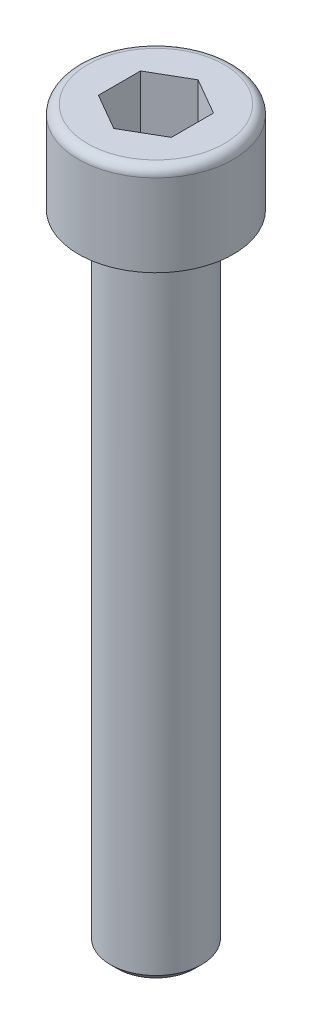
ISO-10303-21;
HEADER;
FILE_DESCRIPTION(('STEP AP214'),'2;1');
FILE_NAME('part.step','',(''),(''),'','','');
FILE_SCHEMA(('AUTOMOTIVE_DESIGN { 1 0 10303 214 1 1 1 1 }'));
ENDSEC;
DATA;
#1=APPLICATION_CONTEXT('core data for automotive mechanical design processes');
#2=APPLICATION_PROTOCOL_DEFINITION('international standard','automotive_design',2000,#1);
#3=PRODUCT_CONTEXT('',#1,'mechanical');
#4=PRODUCT('Part','Part','',(#3));
#5=PRODUCT_RELATED_PRODUCT_CATEGORY('part','',(#4));
#6=PRODUCT_DEFINITION_FORMATION('','',#4);
#7=PRODUCT_DEFINITION_CONTEXT('part definition',#1,'design');
#8=PRODUCT_DEFINITION('design','',#6,#7);
#9=PRODUCT_DEFINITION_SHAPE('','',#8);
#10=(LENGTH_UNIT() NAMED_UNIT(*) SI_UNIT(.MILLI.,.METRE.));
#11=(NAMED_UNIT(*) PLANE_ANGLE_UNIT() SI_UNIT($,.RADIAN.));
#12=(NAMED_UNIT(*) SI_UNIT($,.STERADIAN.) SOLID_ANGLE_UNIT());
#13=UNCERTAINTY_MEASURE_WITH_UNIT(LENGTH_MEASURE(1.E-05),#10,'distance_accuracy_value','');
#14=(GEOMETRIC_REPRESENTATION_CONTEXT(3) GLOBAL_UNCERTAINTY_ASSIGNED_CONTEXT((#13)) GLOBAL_UNIT_ASSIGNED_CONTEXT((#10,
#11,#12)) REPRESENTATION_CONTEXT('',''));
#15=CARTESIAN_POINT('',(0.,0.,0.));
#16=DIRECTION('',(0.,0.,1.));
#17=DIRECTION('',(1.,0.,0.));
#18=AXIS2_PLACEMENT_3D('',#15,#16,#17);
#19=CARTESIAN_POINT('',(2.50000000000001,-40.,0.));
#20=DIRECTION('',(0.,-1.,0.));
#21=DIRECTION('',(1.,0.,0.));
#22=AXIS2_PLACEMENT_3D('',#19,#20,#21);
#23=PLANE('',#22);
#24=CARTESIAN_POINT('',(0.,-40.,0.));
#25=DIRECTION('',(0.,-1.,0.));
#26=DIRECTION('',(1.,0.,0.));
#27=AXIS2_PLACEMENT_3D('',#24,#25,#26);
#28=CIRCLE('',#27,2.09999999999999);
#29=CARTESIAN_POINT('',(2.10000000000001,-40.,0.));
#30=VERTEX_POINT('',#29);
#31=EDGE_CURVE('E11',#30,#30,#28,.T.);
#32=ORIENTED_EDGE('',*,*,#31,.T.);
#33=EDGE_LOOP('',(#32));
#34=FACE_BOUND('',#33,.T.);
#35=ADVANCED_FACE('F30',(#34),#23,.T.);
#36=CARTESIAN_POINT('',(0.,65.1172922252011,0.));
#37=DIRECTION('',(0.,1.,0.));
#38=DIRECTION('',(-1.,0.,0.));
#39=AXIS2_PLACEMENT_3D('',#36,#37,#38);
#40=CYLINDRICAL_SURFACE('',#39,2.49999999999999);
#41=CARTESIAN_POINT('',(0.,-39.6,0.));
#42=DIRECTION('',(0.,-1.,0.));
#43=DIRECTION('',(1.,0.,0.));
#44=AXIS2_PLACEMENT_3D('',#41,#42,#43);
#45=CIRCLE('',#44,2.49999999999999);
#46=CARTESIAN_POINT('',(2.5,-39.6,0.));
#47=VERTEX_POINT('',#46);
#48=EDGE_CURVE('E37',#47,#47,#45,.F.);
#49=ORIENTED_EDGE('',*,*,#48,.T.);
#50=EDGE_LOOP('',(#49));
#51=FACE_BOUND('',#50,.T.);
#52=CARTESIAN_POINT('',(0.,-5.,0.));
#53=DIRECTION('',(0.,1.,0.));
#54=DIRECTION('',(-1.,0.,0.));
#55=AXIS2_PLACEMENT_3D('',#52,#53,#54);
#56=CIRCLE('',#55,2.49999999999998);
#57=CARTESIAN_POINT('',(-2.49999999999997,-5.,0.));
#58=VERTEX_POINT('',#57);
#59=EDGE_CURVE('E145',#58,#58,#56,.T.);
#60=ORIENTED_EDGE('',*,*,#59,.F.);
#61=EDGE_LOOP('',(#60));
#62=FACE_BOUND('',#61,.T.);
#63=ADVANCED_FACE('F150',(#51,#62),#40,.T.);
#64=CARTESIAN_POINT('',(2.49999999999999,-5.,0.));
#65=DIRECTION('',(0.,1.,0.));
#66=DIRECTION('',(-1.,0.,0.));
#67=AXIS2_PLACEMENT_3D('',#64,#65,#66);
#68=PLANE('',#67);
#69=CARTESIAN_POINT('',(0.,-5.,0.));
#70=DIRECTION('',(0.,1.,0.));
#71=DIRECTION('',(-1.,0.,0.));
#72=AXIS2_PLACEMENT_3D('',#69,#70,#71);
#73=CIRCLE('',#72,4.24999999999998);
#74=CARTESIAN_POINT('',(-4.24999999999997,-5.00000000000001,0.));
#75=VERTEX_POINT('',#74);
#76=EDGE_CURVE('E142',#75,#75,#73,.T.);
#77=ORIENTED_EDGE('',*,*,#76,.F.);
#78=EDGE_LOOP('',(#77));
#79=FACE_BOUND('',#78,.T.);
#80=ORIENTED_EDGE('',*,*,#59,.T.);
#81=EDGE_LOOP('',(#80));
#82=FACE_BOUND('',#81,.T.);
#83=ADVANCED_FACE('F174',(#79,#82),#68,.F.);
#84=CARTESIAN_POINT('',(0.,65.1172922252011,0.));
#85=DIRECTION('',(0.,1.,0.));
#86=DIRECTION('',(-1.,0.,0.));
#87=AXIS2_PLACEMENT_3D('',#84,#85,#86);
#88=CYLINDRICAL_SURFACE('',#87,4.24999999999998);
#89=CARTESIAN_POINT('',(0.,-0.5,0.));
#90=DIRECTION('',(0.,1.,0.));
#91=DIRECTION('',(-1.,0.,0.));
#92=AXIS2_PLACEMENT_3D('',#89,#90,#91);
#93=CIRCLE('',#92,4.24999999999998);
#94=CARTESIAN_POINT('',(-4.24999999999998,-0.500000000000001,0.));
#95=VERTEX_POINT('',#94);
#96=EDGE_CURVE('E139',#95,#95,#93,.T.);
#97=ORIENTED_EDGE('',*,*,#96,.F.);
#98=EDGE_LOOP('',(#97));
#99=FACE_BOUND('',#98,.T.);
#100=ORIENTED_EDGE('',*,*,#76,.T.);
#101=EDGE_LOOP('',(#100));
#102=FACE_BOUND('',#101,.T.);
#103=ADVANCED_FACE('F178',(#99,#102),#88,.T.);
#104=CARTESIAN_POINT('',(0.,-0.5,0.));
#105=DIRECTION('',(0.,1.,0.));
#106=DIRECTION('',(-1.,0.,0.));
#107=AXIS2_PLACEMENT_3D('',#104,#105,#106);
#108=TOROIDAL_SURFACE('',#107,3.74999999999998,0.5);
#109=CARTESIAN_POINT('',(0.,0.,0.));
#110=DIRECTION('',(0.,1.,0.));
#111=DIRECTION('',(-1.,0.,0.));
#112=AXIS2_PLACEMENT_3D('',#109,#110,#111);
#113=CIRCLE('',#112,3.74999999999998);
#114=CARTESIAN_POINT('',(-3.74999999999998,0.,0.));
#115=VERTEX_POINT('',#114);
#116=EDGE_CURVE('E130',#115,#115,#113,.T.);
#117=ORIENTED_EDGE('',*,*,#116,.F.);
#118=EDGE_LOOP('',(#117));
#119=FACE_BOUND('',#118,.T.);
#120=ORIENTED_EDGE('',*,*,#96,.T.);
#121=EDGE_LOOP('',(#120));
#122=FACE_BOUND('',#121,.T.);
#123=ADVANCED_FACE('F184',(#119,#122),#108,.T.);
#124=CARTESIAN_POINT('',(3.74999999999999,0.,0.));
#125=DIRECTION('',(0.,-1.,0.));
#126=DIRECTION('',(1.,0.,0.));
#127=AXIS2_PLACEMENT_3D('',#124,#125,#126);
#128=PLANE('',#127);
#129=DIRECTION('',(0.,0.,1.));
#130=VECTOR('',#129,1.);
#131=CARTESIAN_POINT('',(-2.,0.,-1.15470053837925));
#132=LINE('',#131,#130);
#133=CARTESIAN_POINT('',(-2.,0.,-1.15470053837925));
#134=VERTEX_POINT('',#133);
#135=CARTESIAN_POINT('',(-2.,0.,1.15470053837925));
#136=VERTEX_POINT('',#135);
#137=EDGE_CURVE('E107',#134,#136,#132,.T.);
#138=ORIENTED_EDGE('',*,*,#137,.F.);
#139=DIRECTION('',(-0.866025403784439,0.,0.5));
#140=VECTOR('',#139,1.);
#141=CARTESIAN_POINT('',(0.,0.,-2.3094010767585));
#142=LINE('',#141,#140);
#143=CARTESIAN_POINT('',(0.,0.,-2.3094010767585));
#144=VERTEX_POINT('',#143);
#145=EDGE_CURVE('E44',#144,#134,#142,.T.);
#146=ORIENTED_EDGE('',*,*,#145,.F.);
#147=DIRECTION('',(0.866025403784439,0.,0.5));
#148=VECTOR('',#147,1.);
#149=CARTESIAN_POINT('',(0.,0.,-2.3094010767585));
#150=LINE('',#149,#148);
#151=CARTESIAN_POINT('',(2.,0.,-1.15470053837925));
#152=VERTEX_POINT('',#151);
#153=EDGE_CURVE('E351',#144,#152,#150,.T.);
#154=ORIENTED_EDGE('',*,*,#153,.T.);
#155=DIRECTION('',(0.,0.,1.));
#156=VECTOR('',#155,1.);
#157=CARTESIAN_POINT('',(2.,0.,-1.15470053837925));
#158=LINE('',#157,#156);
#159=CARTESIAN_POINT('',(2.,0.,1.15470053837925));
#160=VERTEX_POINT('',#159);
#161=EDGE_CURVE('E348',#152,#160,#158,.T.);
#162=ORIENTED_EDGE('',*,*,#161,.T.);
#163=DIRECTION('',(-0.866025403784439,0.,0.5));
#164=VECTOR('',#163,1.);
#165=CARTESIAN_POINT('',(2.,0.,1.15470053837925));
#166=LINE('',#165,#164);
#167=CARTESIAN_POINT('',(0.,0.,2.3094010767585));
#168=VERTEX_POINT('',#167);
#169=EDGE_CURVE('E345',#160,#168,#166,.T.);
#170=ORIENTED_EDGE('',*,*,#169,.T.);
#171=DIRECTION('',(0.866025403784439,0.,0.5));
#172=VECTOR('',#171,1.);
#173=CARTESIAN_POINT('',(-2.,0.,1.15470053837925));
#174=LINE('',#173,#172);
#175=EDGE_CURVE('E343',#136,#168,#174,.T.);
#176=ORIENTED_EDGE('',*,*,#175,.F.);
#177=EDGE_LOOP('',(#138,#146,#154,#162,#170,#176));
#178=FACE_BOUND('',#177,.T.);
#179=ORIENTED_EDGE('',*,*,#116,.T.);
#180=EDGE_LOOP('',(#179));
#181=FACE_BOUND('',#180,.T.);
#182=ADVANCED_FACE('F188',(#178,#181),#128,.F.);
#183=CARTESIAN_POINT('',(0.,-3.6,-2.3094010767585));
#184=DIRECTION('',(-0.5,0.,-0.866025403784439));
#185=DIRECTION('',(-0.866025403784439,0.,0.5));
#186=AXIS2_PLACEMENT_3D('',#183,#184,#185);
#187=PLANE('',#186);
#188=ORIENTED_EDGE('',*,*,#145,.T.);
#189=DIRECTION('',(0.,1.,0.));
#190=VECTOR('',#189,1.);
#191=CARTESIAN_POINT('',(-2.,-3.6,-1.15470053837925));
#192=LINE('',#191,#190);
#193=CARTESIAN_POINT('',(-2.,-3.6,-1.15470053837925));
#194=VERTEX_POINT('',#193);
#195=EDGE_CURVE('E112',#194,#134,#192,.T.);
#196=ORIENTED_EDGE('',*,*,#195,.F.);
#197=DIRECTION('',(-0.866025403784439,0.,0.5));
#198=VECTOR('',#197,1.);
#199=CARTESIAN_POINT('',(0.,-3.6,-2.3094010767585));
#200=LINE('',#199,#198);
#201=CARTESIAN_POINT('',(0.,-3.6,-2.3094010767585));
#202=VERTEX_POINT('',#201);
#203=EDGE_CURVE('E101',#202,#194,#200,.T.);
#204=ORIENTED_EDGE('',*,*,#203,.F.);
#205=DIRECTION('',(0.,1.,0.));
#206=VECTOR('',#205,1.);
#207=CARTESIAN_POINT('',(0.,-3.6,-2.3094010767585));
#208=LINE('',#207,#206);
#209=EDGE_CURVE('E128',#202,#144,#208,.T.);
#210=ORIENTED_EDGE('',*,*,#209,.T.);
#211=EDGE_LOOP('',(#188,#196,#204,#210));
#212=FACE_BOUND('',#211,.T.);
#213=ADVANCED_FACE('F192',(#212),#187,.F.);
#214=CARTESIAN_POINT('',(0.,-3.6,-2.3094010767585));
#215=DIRECTION('',(-0.5,0.,0.866025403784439));
#216=DIRECTION('',(0.866025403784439,0.,0.5));
#217=AXIS2_PLACEMENT_3D('',#214,#215,#216);
#218=PLANE('',#217);
#219=ORIENTED_EDGE('',*,*,#153,.F.);
#220=ORIENTED_EDGE('',*,*,#209,.F.);
#221=DIRECTION('',(0.866025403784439,0.,0.5));
#222=VECTOR('',#221,1.);
#223=CARTESIAN_POINT('',(0.,-3.6,-2.3094010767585));
#224=LINE('',#223,#222);
#225=CARTESIAN_POINT('',(2.,-3.6,-1.15470053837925));
#226=VERTEX_POINT('',#225);
#227=EDGE_CURVE('E125',#202,#226,#224,.T.);
#228=ORIENTED_EDGE('',*,*,#227,.T.);
#229=DIRECTION('',(0.,1.,0.));
#230=VECTOR('',#229,1.);
#231=CARTESIAN_POINT('',(2.,-3.6,-1.15470053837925));
#232=LINE('',#231,#230);
#233=EDGE_CURVE('E131',#226,#152,#232,.T.);
#234=ORIENTED_EDGE('',*,*,#233,.T.);
#235=EDGE_LOOP('',(#219,#220,#228,#234));
#236=FACE_BOUND('',#235,.T.);
#237=ADVANCED_FACE('F196',(#236),#218,.T.);
#238=CARTESIAN_POINT('',(2.,-3.6,-1.15470053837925));
#239=DIRECTION('',(-1.,0.,0.));
#240=DIRECTION('',(0.,-1.,0.));
#241=AXIS2_PLACEMENT_3D('',#238,#239,#240);
#242=PLANE('',#241);
#243=ORIENTED_EDGE('',*,*,#161,.F.);
#244=ORIENTED_EDGE('',*,*,#233,.F.);
#245=DIRECTION('',(0.,0.,1.));
#246=VECTOR('',#245,1.);
#247=CARTESIAN_POINT('',(2.,-3.6,-1.15470053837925));
#248=LINE('',#247,#246);
#249=CARTESIAN_POINT('',(2.,-3.6,1.15470053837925));
#250=VERTEX_POINT('',#249);
#251=EDGE_CURVE('E119',#226,#250,#248,.T.);
#252=ORIENTED_EDGE('',*,*,#251,.T.);
#253=DIRECTION('',(0.,1.,0.));
#254=VECTOR('',#253,1.);
#255=CARTESIAN_POINT('',(2.,-3.6,1.15470053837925));
#256=LINE('',#255,#254);
#257=EDGE_CURVE('E133',#250,#160,#256,.T.);
#258=ORIENTED_EDGE('',*,*,#257,.T.);
#259=EDGE_LOOP('',(#243,#244,#252,#258));
#260=FACE_BOUND('',#259,.T.);
#261=ADVANCED_FACE('F204',(#260),#242,.T.);
#262=CARTESIAN_POINT('',(2.,-3.6,1.15470053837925));
#263=DIRECTION('',(-0.5,0.,-0.866025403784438));
#264=DIRECTION('',(-0.866025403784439,0.,0.5));
#265=AXIS2_PLACEMENT_3D('',#262,#263,#264);
#266=PLANE('',#265);
#267=ORIENTED_EDGE('',*,*,#169,.F.);
#268=ORIENTED_EDGE('',*,*,#257,.F.);
#269=DIRECTION('',(-0.866025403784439,0.,0.5));
#270=VECTOR('',#269,1.);
#271=CARTESIAN_POINT('',(2.,-3.6,1.15470053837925));
#272=LINE('',#271,#270);
#273=CARTESIAN_POINT('',(0.,-3.6,2.3094010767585));
#274=VERTEX_POINT('',#273);
#275=EDGE_CURVE('E116',#250,#274,#272,.T.);
#276=ORIENTED_EDGE('',*,*,#275,.T.);
#277=DIRECTION('',(0.,1.,0.));
#278=VECTOR('',#277,1.);
#279=CARTESIAN_POINT('',(0.,-3.6,2.3094010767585));
#280=LINE('',#279,#278);
#281=EDGE_CURVE('E111',#274,#168,#280,.T.);
#282=ORIENTED_EDGE('',*,*,#281,.T.);
#283=EDGE_LOOP('',(#267,#268,#276,#282));
#284=FACE_BOUND('',#283,.T.);
#285=ADVANCED_FACE('F201',(#284),#266,.T.);
#286=CARTESIAN_POINT('',(-2.,-3.6,1.15470053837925));
#287=DIRECTION('',(-0.5,0.,0.866025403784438));
#288=DIRECTION('',(0.866025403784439,0.,0.5));
#289=AXIS2_PLACEMENT_3D('',#286,#287,#288);
#290=PLANE('',#289);
#291=ORIENTED_EDGE('',*,*,#175,.T.);
#292=ORIENTED_EDGE('',*,*,#281,.F.);
#293=DIRECTION('',(0.866025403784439,0.,0.5));
#294=VECTOR('',#293,1.);
#295=CARTESIAN_POINT('',(-2.,-3.6,1.15470053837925));
#296=LINE('',#295,#294);
#297=CARTESIAN_POINT('',(-2.,-3.6,1.15470053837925));
#298=VERTEX_POINT('',#297);
#299=EDGE_CURVE('E52',#298,#274,#296,.T.);
#300=ORIENTED_EDGE('',*,*,#299,.F.);
#301=DIRECTION('',(0.,1.,0.));
#302=VECTOR('',#301,1.);
#303=CARTESIAN_POINT('',(-2.,-3.6,1.15470053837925));
#304=LINE('',#303,#302);
#305=EDGE_CURVE('E104',#298,#136,#304,.T.);
#306=ORIENTED_EDGE('',*,*,#305,.T.);
#307=EDGE_LOOP('',(#291,#292,#300,#306));
#308=FACE_BOUND('',#307,.T.);
#309=ADVANCED_FACE('F115',(#308),#290,.F.);
#310=CARTESIAN_POINT('',(-2.,-3.6,-1.15470053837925));
#311=DIRECTION('',(-1.,0.,0.));
#312=DIRECTION('',(0.,-1.,0.));
#313=AXIS2_PLACEMENT_3D('',#310,#311,#312);
#314=PLANE('',#313);
#315=ORIENTED_EDGE('',*,*,#137,.T.);
#316=ORIENTED_EDGE('',*,*,#305,.F.);
#317=DIRECTION('',(0.,0.,1.));
#318=VECTOR('',#317,1.);
#319=CARTESIAN_POINT('',(-2.,-3.6,-1.15470053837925));
#320=LINE('',#319,#318);
#321=EDGE_CURVE('E94',#194,#298,#320,.T.);
#322=ORIENTED_EDGE('',*,*,#321,.F.);
#323=ORIENTED_EDGE('',*,*,#195,.T.);
#324=EDGE_LOOP('',(#315,#316,#322,#323));
#325=FACE_BOUND('',#324,.T.);
#326=ADVANCED_FACE('F105',(#325),#314,.F.);
#327=CARTESIAN_POINT('',(-2.,-3.6,-1.15470053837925));
#328=DIRECTION('',(0.0980580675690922,0.98058067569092,0.169841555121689));
#329=DIRECTION('',(0.,-0.170664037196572,0.985329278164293));
#330=AXIS2_PLACEMENT_3D('',#327,#328,#329);
#331=PLANE('',#330);
#332=DIRECTION('',(-0.853320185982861,0.170664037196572,-0.492664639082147));
#333=VECTOR('',#332,1.);
#334=CARTESIAN_POINT('',(0.,-4.,0.));
#335=LINE('',#334,#333);
#336=CARTESIAN_POINT('',(0.,-4.,0.));
#337=VERTEX_POINT('',#336);
#338=EDGE_CURVE('E98',#337,#194,#335,.T.);
#339=ORIENTED_EDGE('',*,*,#338,.F.);
#340=DIRECTION('',(0.,0.170664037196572,-0.985329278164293));
#341=VECTOR('',#340,1.);
#342=CARTESIAN_POINT('',(0.,-4.,0.));
#343=LINE('',#342,#341);
#344=EDGE_CURVE('E336',#337,#202,#343,.T.);
#345=ORIENTED_EDGE('',*,*,#344,.T.);
#346=ORIENTED_EDGE('',*,*,#203,.T.);
#347=EDGE_LOOP('',(#339,#345,#346));
#348=FACE_BOUND('',#347,.T.);
#349=ADVANCED_FACE('F158',(#348),#331,.T.);
#350=CARTESIAN_POINT('',(0.,-3.6,-2.3094010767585));
#351=DIRECTION('',(-0.0980580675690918,0.98058067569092,0.169841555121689));
#352=DIRECTION('',(0.,-0.170664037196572,0.985329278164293));
#353=AXIS2_PLACEMENT_3D('',#350,#351,#352);
#354=PLANE('',#353);
#355=ORIENTED_EDGE('',*,*,#344,.F.);
#356=DIRECTION('',(0.853320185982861,0.170664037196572,-0.492664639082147));
#357=VECTOR('',#356,1.);
#358=CARTESIAN_POINT('',(0.,-4.,0.));
#359=LINE('',#358,#357);
#360=EDGE_CURVE('E90',#337,#226,#359,.T.);
#361=ORIENTED_EDGE('',*,*,#360,.T.);
#362=ORIENTED_EDGE('',*,*,#227,.F.);
#363=EDGE_LOOP('',(#355,#361,#362));
#364=FACE_BOUND('',#363,.T.);
#365=ADVANCED_FACE('F166',(#364),#354,.T.);
#366=CARTESIAN_POINT('',(-2.,-3.6,1.15470053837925));
#367=DIRECTION('',(0.196116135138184,0.98058067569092,0.));
#368=DIRECTION('',(-0.98058067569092,0.196116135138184,0.));
#369=AXIS2_PLACEMENT_3D('',#366,#367,#368);
#370=PLANE('',#369);
#371=DIRECTION('',(-0.853320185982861,0.170664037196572,0.492664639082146));
#372=VECTOR('',#371,1.);
#373=CARTESIAN_POINT('',(0.,-4.,0.));
#374=LINE('',#373,#372);
#375=EDGE_CURVE('E84',#337,#298,#374,.T.);
#376=ORIENTED_EDGE('',*,*,#375,.F.);
#377=ORIENTED_EDGE('',*,*,#338,.T.);
#378=ORIENTED_EDGE('',*,*,#321,.T.);
#379=EDGE_LOOP('',(#376,#377,#378));
#380=FACE_BOUND('',#379,.T.);
#381=ADVANCED_FACE('F96',(#380),#370,.T.);
#382=CARTESIAN_POINT('',(2.,-3.6,-1.15470053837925));
#383=DIRECTION('',(-0.196116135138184,0.98058067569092,0.));
#384=DIRECTION('',(-0.98058067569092,-0.196116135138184,0.));
#385=AXIS2_PLACEMENT_3D('',#382,#383,#384);
#386=PLANE('',#385);
#387=ORIENTED_EDGE('',*,*,#360,.F.);
#388=DIRECTION('',(0.853320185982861,0.170664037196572,0.492664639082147));
#389=VECTOR('',#388,1.);
#390=CARTESIAN_POINT('',(0.,-4.,0.));
#391=LINE('',#390,#389);
#392=EDGE_CURVE('E91',#337,#250,#391,.T.);
#393=ORIENTED_EDGE('',*,*,#392,.T.);
#394=ORIENTED_EDGE('',*,*,#251,.F.);
#395=EDGE_LOOP('',(#387,#393,#394));
#396=FACE_BOUND('',#395,.T.);
#397=ADVANCED_FACE('F217',(#396),#386,.T.);
#398=CARTESIAN_POINT('',(0.,-3.6,2.3094010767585));
#399=DIRECTION('',(0.0980580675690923,0.98058067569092,-0.169841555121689));
#400=DIRECTION('',(0.,0.170664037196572,0.985329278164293));
#401=AXIS2_PLACEMENT_3D('',#398,#399,#400);
#402=PLANE('',#401);
#403=DIRECTION('',(0.,0.170664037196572,0.985329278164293));
#404=VECTOR('',#403,1.);
#405=CARTESIAN_POINT('',(0.,-4.,0.));
#406=LINE('',#405,#404);
#407=EDGE_CURVE('E87',#337,#274,#406,.T.);
#408=ORIENTED_EDGE('',*,*,#407,.F.);
#409=ORIENTED_EDGE('',*,*,#375,.T.);
#410=ORIENTED_EDGE('',*,*,#299,.T.);
#411=EDGE_LOOP('',(#408,#409,#410));
#412=FACE_BOUND('',#411,.T.);
#413=ADVANCED_FACE('F86',(#412),#402,.T.);
#414=CARTESIAN_POINT('',(2.,-3.6,1.15470053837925));
#415=DIRECTION('',(-0.0980580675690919,0.98058067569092,-0.169841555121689));
#416=DIRECTION('',(0.,0.170664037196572,0.985329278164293));
#417=AXIS2_PLACEMENT_3D('',#414,#415,#416);
#418=PLANE('',#417);
#419=ORIENTED_EDGE('',*,*,#392,.F.);
#420=ORIENTED_EDGE('',*,*,#407,.T.);
#421=ORIENTED_EDGE('',*,*,#275,.F.);
#422=EDGE_LOOP('',(#419,#420,#421));
#423=FACE_BOUND('',#422,.T.);
#424=ADVANCED_FACE('F155',(#423),#418,.T.);
#425=CARTESIAN_POINT('',(0.,-39.6,0.));
#426=DIRECTION('',(0.,1.,0.));
#427=DIRECTION('',(-1.,0.,0.));
#428=AXIS2_PLACEMENT_3D('',#425,#426,#427);
#429=CONICAL_SURFACE('',#428,2.49999999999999,0.785398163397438);
#430=ORIENTED_EDGE('',*,*,#31,.F.);
#431=EDGE_LOOP('',(#430));
#432=FACE_BOUND('',#431,.T.);
#433=ORIENTED_EDGE('',*,*,#48,.F.);
#434=EDGE_LOOP('',(#433));
#435=FACE_BOUND('',#434,.T.);
#436=ADVANCED_FACE('F153',(#432,#435),#429,.T.);
#437=CLOSED_SHELL('',(#35,#63,#83,#103,#123,#182,#213,#237,#261,#285,#309,#326,#349,#365,#381,
#397,#413,#424,#436));
#438=MANIFOLD_SOLID_BREP('B2',#437);
#439=ADVANCED_BREP_SHAPE_REPRESENTATION('',(#18,#438),#14);
#440=SHAPE_DEFINITION_REPRESENTATION(#9,#439);
ENDSEC;
END-ISO-10303-21;
